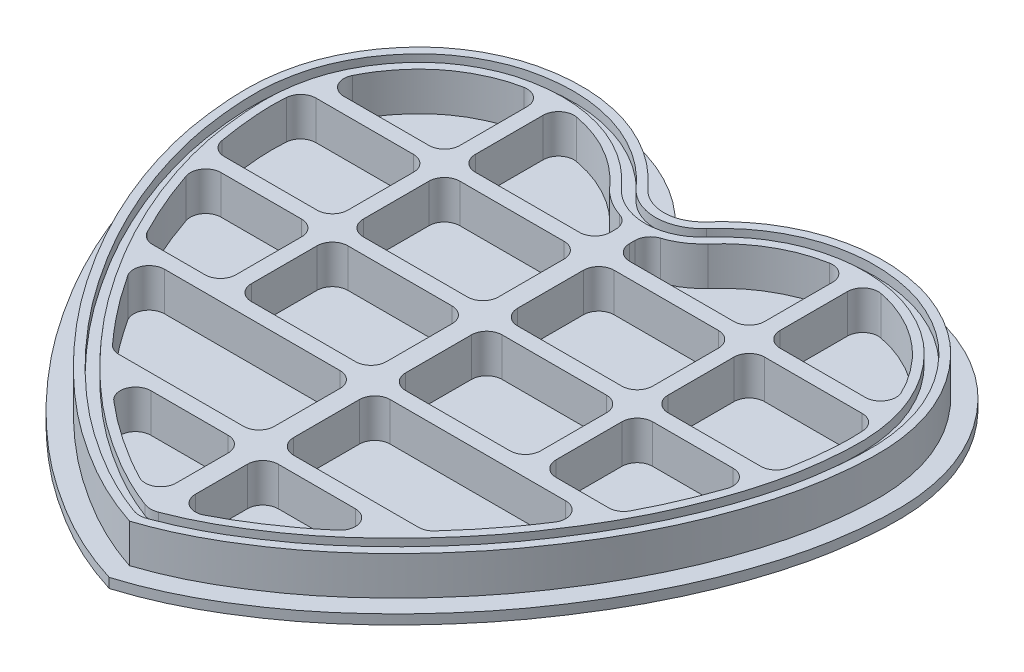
from build123d import *

# Parameters (mm, degrees)
BOSS_EXTRUDE1_DEPTH = 3.175
BOSS_EXTRUDE3_DEPTH = 12.7
SKETCH5_W           = 44.414591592
SKETCH5_H           = 31.75
SKETCH5_W_2         = 44.414591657
CUT_EXTRUDE1_DEPTH  = 12.7
FILLET1_R           = 5.08
CUT_EXTRUDE2_DEPTH  = 3.175
FILLET2_R           = 6.35


with BuildPart() as part:
    # Sketch1 → Boss-Extrude1 (new body)
    with BuildSketch(Plane(origin=(0, 0, 0), x_dir=(1, 0, 0), z_dir=(0, 1, 0))):
        with BuildLine():
            ThreePointArc((-4.747482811, 190.872547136), (0, 188.739644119), (4.747482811, 190.872547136))
            add(Edge.make_bspline(
                [(0, 0), (6.970442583, 2.141082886), (17.305199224, 6.509209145), (30.285067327, 14.366317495), (40.150784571, 21.183484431), (49.603424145, 29.074254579), (58.742982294, 37.735887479), (67.378539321, 47.138207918), (75.575238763, 57.113294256), (82.955034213, 67.748431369), (89.791932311, 78.721655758), (95.737965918, 90.115832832), (100.824893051, 101.755437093), (104.934029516, 113.602894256), (108.033406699, 125.514887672), (109.756308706, 137.469723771), (110.447054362, 147.556494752), (110.063190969, 155.716052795), (109.107499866, 161.898362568), (107.688011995, 167.863159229), (105.613562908, 173.559818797), (103.038708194, 178.971158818), (99.994025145, 184.084018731), (96.490424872, 188.811355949), (92.627716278, 193.232091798), (88.353251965, 197.256826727), (83.64560959, 200.815640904), (78.636807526, 203.933154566), (73.292192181, 206.507896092), (67.725724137, 208.658006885), (61.858228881, 210.069885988), (55.85226772, 211.016437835), (49.237488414, 211.368814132), (42.178295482, 210.949739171), (34.84505005, 209.532701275), (27.821079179, 207.307972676), (21.216319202, 204.168334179), (15.02880887, 200.345742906), (9.553920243, 195.844598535), (6.241235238, 192.554169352), (4.747482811, 190.872547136)],
                knots=[0, 0, 0, 0, 0.062261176, 0.095309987, 0.1294716, 0.164592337, 0.200365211, 0.236952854, 0.273568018, 0.310548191, 0.347436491, 0.383932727, 0.420222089, 0.455836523, 0.490947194, 0.525166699, 0.558872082, 0.577132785, 0.59481426, 0.612232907, 0.629419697, 0.646490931, 0.663353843, 0.68016217, 0.696680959, 0.713439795, 0.730210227, 0.74701014, 0.763742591, 0.780817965, 0.79787159, 0.815181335, 0.832691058, 0.854351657, 0.875405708, 0.896334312, 0.917107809, 0.937713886, 0.958296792, 0.977512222, 0.977512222, 0.977512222, 0.977512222], degree=3))
            add(Edge.make_bspline(
                [(0, 0), (-6.970442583, 2.141082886), (-17.305199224, 6.509209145), (-30.285067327, 14.366317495), (-40.150784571, 21.183484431), (-49.603424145, 29.074254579), (-58.742982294, 37.735887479), (-67.378539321, 47.138207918), (-75.575238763, 57.113294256), (-82.955034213, 67.748431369), (-89.791932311, 78.721655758), (-95.737965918, 90.115832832), (-100.824893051, 101.755437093), (-104.934029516, 113.602894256), (-108.033406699, 125.514887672), (-109.756308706, 137.469723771), (-110.447054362, 147.556494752), (-110.063190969, 155.716052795), (-109.107499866, 161.898362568), (-107.688011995, 167.863159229), (-105.613562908, 173.559818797), (-103.038708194, 178.971158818), (-99.994025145, 184.084018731), (-96.490424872, 188.811355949), (-92.627716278, 193.232091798), (-88.353251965, 197.256826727), (-83.64560959, 200.815640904), (-78.636807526, 203.933154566), (-73.292192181, 206.507896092), (-67.725724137, 208.658006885), (-61.858228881, 210.069885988), (-55.85226772, 211.016437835), (-49.237488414, 211.368814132), (-42.178295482, 210.949739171), (-34.84505005, 209.532701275), (-27.821079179, 207.307972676), (-21.216319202, 204.168334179), (-15.02880887, 200.345742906), (-9.553920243, 195.844598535), (-6.241235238, 192.554169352), (-4.747482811, 190.872547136)],
                knots=[0, 0, 0, 0, 0.062261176, 0.095309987, 0.1294716, 0.164592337, 0.200365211, 0.236952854, 0.273568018, 0.310548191, 0.347436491, 0.383932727, 0.420222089, 0.455836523, 0.490947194, 0.525166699, 0.558872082, 0.577132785, 0.59481426, 0.612232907, 0.629419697, 0.646490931, 0.663353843, 0.68016217, 0.696680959, 0.713439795, 0.730210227, 0.74701014, 0.763742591, 0.780817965, 0.79787159, 0.815181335, 0.832691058, 0.854351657, 0.875405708, 0.896334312, 0.917107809, 0.937713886, 0.958296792, 0.977512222, 0.977512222, 0.977512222, 0.977512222], degree=3))
        make_face()
    extrude(amount=BOSS_EXTRUDE1_DEPTH)

    # Sketch4 → Boss-Extrude3 (add)
    with BuildSketch(Plane(origin=(0, 3.175, 0), x_dir=(1, 0, 0), z_dir=(0, 1, 0))):
        with BuildLine():
            ThreePointArc((-9.494965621, 186.655450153), (0, 182.389644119), (9.494965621, 186.655450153))
            add(Edge.make_bspline(
                [(0, 6.662641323), (3.181841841, 7.707771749), (6.285990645, 8.901039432), (12.350490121, 11.561754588), (15.310465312, 13.029917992), (21.093504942, 16.227292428), (23.918881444, 17.952095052), (28.096349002, 20.654839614), (29.478667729, 21.575146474), (32.218537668, 23.462984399), (33.577568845, 24.431734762), (37.58122483, 27.40018831), (40.155182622, 29.472921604), (45.162919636, 33.75653076), (47.601691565, 35.962486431), (52.358131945, 40.493742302), (54.671953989, 42.822833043), (59.174698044, 47.604100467), (61.366446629, 50.053491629), (65.648634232, 55.052112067), (67.735834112, 57.604533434), (70.754266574, 61.54390078), (71.74089275, 62.876257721), (73.679788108, 65.574829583), (74.630438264, 66.938411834), (76.494971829, 69.679713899), (77.410342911, 71.058788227), (79.212522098, 73.831176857), (80.098316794, 75.224996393), (82.700482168, 79.433984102), (84.358850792, 82.278069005), (87.492518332, 88.057507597), (88.972881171, 90.990336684), (91.772460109, 96.936334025), (93.09027817, 99.950199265), (95.540218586, 106.070507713), (96.671550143, 109.177345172), (98.220571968, 113.911374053), (98.712774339, 115.502237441), (99.643955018, 118.707095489), (100.08035297, 120.314687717), (100.884795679, 123.54196168), (101.252845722, 125.161642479), (101.910121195, 128.414945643), (102.199079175, 130.048615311), (102.709192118, 133.327946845), (102.930348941, 134.973608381), (103.315851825, 138.274979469), (103.482880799, 139.9302145), (103.748659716, 143.252760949), (103.84583959, 144.91913922), (103.941219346, 148.238366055), (103.940020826, 149.894222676), (103.810934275, 153.196200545), (103.680827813, 154.842151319), (103.265645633, 158.122144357), (102.986498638, 159.756642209), (102.311354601, 163.016658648), (101.908240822, 164.649551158), (100.938478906, 167.823729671), (100.373143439, 169.372323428), (99.113988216, 172.408034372), (98.420322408, 173.895225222), (96.906703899, 176.809181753), (96.087453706, 178.236283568), (94.754465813, 180.327120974), (94.292326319, 181.015545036), (93.333339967, 182.375786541), (92.835604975, 183.0491751), (91.308755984, 185.030162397), (90.246665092, 186.30553099), (88.024632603, 188.755986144), (86.862916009, 189.929253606), (84.425164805, 192.158630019), (83.147012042, 193.212568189), (81.146040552, 194.707652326), (80.464470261, 195.192796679), (79.080538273, 196.134131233), (78.380961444, 196.588127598), (76.965405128, 197.460191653), (76.249426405, 197.878261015), (74.799757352, 198.675603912), (74.066068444, 199.054880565), (72.583546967, 199.78026292), (71.834712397, 200.12636424), (70.324209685, 200.79045599), (69.562862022, 201.109148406), (68.024207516, 201.711575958), (67.246860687, 201.995223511), (65.671370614, 202.51696577), (64.872483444, 202.75343097), (63.255016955, 203.183227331), (62.436294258, 203.377158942), (60.800475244, 203.729316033), (59.981093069, 203.889185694), (57.518706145, 204.322122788), (55.871167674, 204.545289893), (52.561606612, 204.832204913), (50.899823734, 204.898591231), (48.396790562, 204.88415615), (47.560706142, 204.860192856), (45.884899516, 204.772227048), (45.045459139, 204.708093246), (42.549210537, 204.45603933), (40.905738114, 204.206531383), (37.656381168, 203.559527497), (36.049925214, 203.164281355), (32.873279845, 202.231003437), (31.303718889, 201.690497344), (28.982643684, 200.748765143), (28.213988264, 200.413287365), (26.688456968, 199.703084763), (25.937184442, 199.331016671), (23.714130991, 198.169396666), (22.271091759, 197.337414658), (20.173044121, 195.991254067), (19.484928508, 195.525950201), (18.133260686, 194.559080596), (17.469702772, 194.057523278), (15.511572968, 192.504808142), (14.248520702, 191.406639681), (11.792698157, 189.108482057), (10.612083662, 187.913068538), (9.494965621, 186.655450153)],
                knots=[0, 0, 0, 0, 0.03125, 0.03125, 0.0625, 0.0625, 0.09375, 0.09375, 0.109375, 0.109375, 0.125, 0.125, 0.15625, 0.15625, 0.1875, 0.1875, 0.21875, 0.21875, 0.25, 0.25, 0.28125, 0.28125, 0.296875, 0.296875, 0.3125, 0.3125, 0.328125, 0.328125, 0.34375, 0.34375, 0.375, 0.375, 0.40625, 0.40625, 0.4375, 0.4375, 0.46875, 0.46875, 0.484375, 0.484375, 0.5, 0.5, 0.515625, 0.515625, 0.53125, 0.53125, 0.546875, 0.546875, 0.5625, 0.5625, 0.578125, 0.578125, 0.59375, 0.59375, 0.609375, 0.609375, 0.625, 0.625, 0.640625, 0.640625, 0.65625, 0.65625, 0.671875, 0.671875, 0.6875, 0.6875, 0.6953125, 0.6953125, 0.703125, 0.703125, 0.71875, 0.71875, 0.734375, 0.734375, 0.75, 0.75, 0.7578125, 0.7578125, 0.765625, 0.765625, 0.7734375, 0.7734375, 0.78125, 0.78125, 0.7890625, 0.7890625, 0.796875, 0.796875, 0.8046875, 0.8046875, 0.8125, 0.8125, 0.8203125, 0.8203125, 0.828125, 0.828125, 0.84375, 0.84375, 0.859375, 0.859375, 0.8671875, 0.8671875, 0.875, 0.875, 0.890625, 0.890625, 0.90625, 0.90625, 0.921875, 0.921875, 0.9296875, 0.9296875, 0.9375, 0.9375, 0.953125, 0.953125, 0.9609375, 0.9609375, 0.96875, 0.96875, 0.984375, 0.984375, 1, 1, 1, 1], degree=3))
            add(Edge.make_bspline(
                [(-9.494965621, 186.655450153), (-10.609815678, 187.910515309), (-11.780868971, 189.096022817), (-14.204196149, 191.36651847), (-15.45344557, 192.455249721), (-17.397313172, 194.001722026), (-18.057184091, 194.502466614), (-19.404222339, 195.470173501), (-20.091508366, 195.936988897), (-21.491613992, 196.839019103), (-22.204429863, 197.274238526), (-23.653760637, 198.115347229), (-24.390379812, 198.521505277), (-26.612461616, 199.68622144), (-28.118071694, 200.393636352), (-31.185995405, 201.64679261), (-32.749122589, 202.190214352), (-35.926273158, 203.131942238), (-37.539395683, 203.532816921), (-39.996630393, 204.027063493), (-40.824393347, 204.173796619), (-42.481525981, 204.42615659), (-43.309978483, 204.531572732), (-45.794998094, 204.786176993), (-47.451233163, 204.874789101), (-50.762877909, 204.901432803), (-52.418290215, 204.839944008), (-55.728265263, 204.561975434), (-57.384635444, 204.342229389), (-59.862965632, 203.911500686), (-60.683691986, 203.752641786), (-62.314578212, 203.404929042), (-63.124395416, 203.215102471), (-64.729373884, 202.793845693), (-65.524391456, 202.562007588), (-67.096682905, 202.047962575), (-67.87448419, 201.767252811), (-69.417001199, 201.168687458), (-70.181725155, 200.85085524), (-71.701215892, 200.186925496), (-72.455820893, 199.840368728), (-73.952739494, 199.112363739), (-74.695055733, 198.730923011), (-76.165101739, 197.926635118), (-76.890522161, 197.504683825), (-79.023584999, 196.195278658), (-80.39738752, 195.262732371), (-83.054448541, 193.285754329), (-84.333980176, 192.236717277), (-86.78515132, 190.005320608), (-87.95870264, 188.825323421), (-89.647895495, 186.967427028), (-90.199441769, 186.33327866), (-91.271797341, 185.049783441), (-91.794338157, 184.399289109), (-93.320761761, 182.42138126), (-94.281529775, 181.066314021), (-96.067910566, 178.269491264), (-96.896220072, 176.829465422), (-98.048269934, 174.611435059), (-98.417030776, 173.862306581), (-99.123420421, 172.344081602), (-99.461602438, 171.573521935), (-100.419392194, 169.253053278), (-100.984727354, 167.688611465), (-101.942857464, 164.518561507), (-102.335210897, 162.91284802), (-103.00129816, 159.67311962), (-103.278735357, 158.039988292), (-103.587898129, 155.564763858), (-103.672348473, 154.735250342), (-103.803429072, 153.067199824), (-103.850537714, 152.228830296), (-104.003834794, 148.056488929), (-103.872055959, 144.74646598), (-103.470679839, 139.803730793), (-103.303595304, 138.159796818), (-102.917862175, 134.877573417), (-102.6965891, 133.239571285), (-102.185807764, 129.971036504), (-101.896289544, 128.340504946), (-101.236754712, 125.088253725), (-100.867133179, 123.466490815), (-100.058184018, 120.230595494), (-99.620361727, 118.622652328), (-98.692151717, 115.434660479), (-98.20187958, 113.852347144), (-96.657484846, 109.138256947), (-95.528590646, 106.039862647), (-93.080722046, 99.927937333), (-91.762550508, 96.914047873), (-88.958539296, 90.961126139), (-87.474138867, 88.021451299), (-84.327088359, 82.221683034), (-82.659144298, 79.363953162), (-80.038725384, 75.130265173), (-79.145305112, 73.726155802), (-77.331655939, 70.939493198), (-76.412630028, 69.556703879), (-73.61231133, 65.445696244), (-71.686192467, 62.756207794), (-67.66823896, 57.520409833), (-65.580757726, 54.970338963), (-61.291655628, 49.968814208), (-59.093401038, 47.514451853), (-54.568612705, 42.716560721), (-52.239062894, 40.375637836), (-48.64030957, 36.954480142), (-47.423721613, 35.828785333), (-44.957328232, 33.606095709), (-43.706279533, 32.507080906), (-39.909556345, 29.270672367), (-37.325889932, 27.20227084), (-32.025946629, 23.290714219), (-29.314433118, 21.439468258), (-23.805721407, 17.882516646), (-21.008002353, 16.177695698), (-15.270127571, 13.009990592), (-12.327537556, 11.551241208), (-6.284987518, 8.901044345), (-3.185411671, 7.708944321), (0, 6.662641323)],
                knots=[0, 0, 0, 0, 0.015625, 0.015625, 0.03125, 0.03125, 0.0390625, 0.0390625, 0.046875, 0.046875, 0.0546875, 0.0546875, 0.0625, 0.0625, 0.078125, 0.078125, 0.09375, 0.09375, 0.109375, 0.109375, 0.1171875, 0.1171875, 0.125, 0.125, 0.140625, 0.140625, 0.15625, 0.15625, 0.171875, 0.171875, 0.1796875, 0.1796875, 0.1875, 0.1875, 0.1953125, 0.1953125, 0.203125, 0.203125, 0.2109375, 0.2109375, 0.21875, 0.21875, 0.2265625, 0.2265625, 0.234375, 0.234375, 0.25, 0.25, 0.265625, 0.265625, 0.28125, 0.28125, 0.2890625, 0.2890625, 0.296875, 0.296875, 0.3125, 0.3125, 0.328125, 0.328125, 0.3359375, 0.3359375, 0.34375, 0.34375, 0.359375, 0.359375, 0.375, 0.375, 0.390625, 0.390625, 0.3984375, 0.3984375, 0.40625, 0.40625, 0.4375, 0.4375, 0.453125, 0.453125, 0.46875, 0.46875, 0.484375, 0.484375, 0.5, 0.5, 0.515625, 0.515625, 0.53125, 0.53125, 0.5625, 0.5625, 0.59375, 0.59375, 0.625, 0.625, 0.65625, 0.65625, 0.671875, 0.671875, 0.6875, 0.6875, 0.71875, 0.71875, 0.75, 0.75, 0.78125, 0.78125, 0.8125, 0.8125, 0.828125, 0.828125, 0.84375, 0.84375, 0.875, 0.875, 0.90625, 0.90625, 0.9375, 0.9375, 0.96875, 0.96875, 1, 1, 1, 1], degree=3))
        make_face()
    extrude(amount=BOSS_EXTRUDE3_DEPTH)

    # Sketch5 → Cut-Extrude1 (cut)
    with BuildSketch(Plane(origin=(0, 15.875, 0), x_dir=(1, 0, 0), z_dir=(0, 1, 0))):
        with BuildLine():
            Line((-47.589591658, 162.905866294), (-3.175000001, 162.905866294))
            Line((-3.175000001, 162.905866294), (-3.175000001, 173.734376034))
            ThreePointArc((-3.175000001, 173.734376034), (-10.275762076, 176.101837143), (-16.141441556, 180.751514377))
            add(Edge.make_bspline(
                [(-16.141441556, 180.751514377), (-17.134877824, 181.869895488), (-18.182186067, 182.919409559), (-20.346497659, 184.92934322), (-21.4624121, 185.891154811), (-23.202990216, 187.24859825), (-23.794738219, 187.686307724), (-25.004666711, 188.527936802), (-25.622362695, 188.93247577), (-26.880681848, 189.712244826), (-27.521309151, 190.087469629), (-28.82328044, 190.811436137), (-29.486356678, 191.161295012), (-31.489577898, 192.157966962), (-32.846848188, 192.751821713), (-35.612370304, 193.774362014), (-37.019232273, 194.207550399), (-39.872688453, 194.945203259), (-41.319487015, 195.249005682), (-43.523415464, 195.59542941), (-44.266150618, 195.692330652), (-45.74981945, 195.845647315), (-46.490787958, 195.902539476), (-47.350508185, 195.946838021), (-47.47006043, 195.952518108), (-47.589591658, 195.957718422)],
                knots=[0, 0, 0, 0, 0.015625, 0.015625, 0.03125, 0.03125, 0.0390625, 0.0390625, 0.046875, 0.046875, 0.0546875, 0.0546875, 0.0625, 0.0625, 0.078125, 0.078125, 0.09375, 0.09375, 0.109375, 0.109375, 0.1171875, 0.1171875, 0.125, 0.125, 0.126262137, 0.126262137, 0.126262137, 0.126262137], degree=3))
            Line((-47.589591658, 195.957718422), (-47.589591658, 162.905866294))
        make_face()
        with BuildLine():
            Line((52.669591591, 195.892387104), (52.669591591, 162.905866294))
            Line((52.669591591, 162.905866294), (93.136976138, 162.905866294))
            add(Edge.make_bspline(
                [(93.136976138, 162.905866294), (93.014719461, 163.33657048), (92.885618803, 163.763912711), (92.523462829, 164.888871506), (92.278813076, 165.580792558), (91.495662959, 167.63238687), (90.910596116, 168.969185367), (89.625036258, 171.586081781), (88.924790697, 172.866301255), (87.398468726, 175.364928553), (86.568299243, 176.581325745), (85.231482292, 178.360943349), (84.773488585, 178.944715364), (83.838725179, 180.089434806), (83.3608776, 180.650844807), (81.893937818, 182.3001338), (80.87048975, 183.352068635), (78.715202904, 185.342536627), (77.581035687, 186.2786337), (75.208285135, 188.041584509), (73.968803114, 188.877218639), (72.072397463, 190.024114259), (71.432448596, 190.388672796), (70.135969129, 191.080142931), (69.479790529, 191.407853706), (68.154493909, 192.033897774), (67.485488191, 192.332486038), (66.136405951, 192.904527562), (65.45593719, 193.17709029), (64.078326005, 193.684360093), (63.380751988, 193.918087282), (61.963665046, 194.335731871), (61.244845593, 194.521223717), (59.792403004, 194.858597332), (59.062620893, 195.010249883), (57.602880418, 195.285823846), (56.871890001, 195.409528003), (54.98637985, 195.68542291), (53.829799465, 195.811707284), (52.669591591, 195.892387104)],
                knots=[0.659341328, 0.659341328, 0.659341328, 0.659341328, 0.6640625, 0.6640625, 0.671875, 0.671875, 0.6875, 0.6875, 0.703125, 0.703125, 0.71875, 0.71875, 0.7265625, 0.7265625, 0.734375, 0.734375, 0.75, 0.75, 0.765625, 0.765625, 0.78125, 0.78125, 0.7890625, 0.7890625, 0.796875, 0.796875, 0.8046875, 0.8046875, 0.8125, 0.8125, 0.8203125, 0.8203125, 0.828125, 0.828125, 0.8359375, 0.8359375, 0.84375, 0.84375, 0.856052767, 0.856052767, 0.856052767, 0.856052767], degree=3))
        make_face()
        with Locations((25.382295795, 141.950866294)):
            Rectangle(SKETCH5_W, SKETCH5_H)
        with BuildLine():
            ThreePointArc((16.141441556, 180.751514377), (10.275762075, 176.101837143), (3.174999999, 173.734376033))
            Line((3.174999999, 173.734376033), (3.174999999, 162.905866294))
            Line((3.174999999, 162.905866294), (47.589591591, 162.905866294))
            Line((47.589591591, 162.905866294), (47.589591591, 195.957663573))
            add(Edge.make_bspline(
                [(47.589591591, 195.957663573), (47.48760758, 195.953226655), (47.385595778, 195.948440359), (46.539747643, 195.905860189), (45.792588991, 195.849277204), (44.311462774, 195.697754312), (43.576127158, 195.602448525), (41.384898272, 195.261279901), (39.943561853, 194.960992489), (37.095855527, 194.229686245), (35.68922372, 193.799646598), (33.611021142, 193.035899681), (32.923765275, 192.760835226), (31.560083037, 192.170217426), (30.881859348, 191.854336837), (28.873894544, 190.858903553), (27.574196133, 190.139446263), (25.685546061, 188.97295159), (25.066422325, 188.569171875), (23.851880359, 187.727625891), (23.256907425, 187.2892212), (21.504836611, 185.926913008), (20.378897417, 184.958337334), (18.191348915, 182.928956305), (17.134366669, 181.869320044), (16.141441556, 180.751514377)],
                knots=[0.873928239, 0.873928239, 0.873928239, 0.873928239, 0.875, 0.875, 0.8828125, 0.8828125, 0.890625, 0.890625, 0.90625, 0.90625, 0.921875, 0.921875, 0.9296875, 0.9296875, 0.9375, 0.9375, 0.953125, 0.953125, 0.9609375, 0.9609375, 0.96875, 0.96875, 0.984375, 0.984375, 1, 1, 1, 1], degree=3))
        make_face()
        with BuildLine():
            Line((94.280557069, 157.825866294), (52.669591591, 157.825866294))
            Line((52.669591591, 157.825866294), (52.669591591, 126.075866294))
            Line((52.669591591, 126.075866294), (92.334289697, 126.075866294))
            add(Edge.make_bspline(
                [(92.334289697, 126.075866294), (92.400784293, 126.366329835), (92.465995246, 126.656986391), (93.164564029, 129.837219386), (93.658918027, 132.748588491), (94.240680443, 137.140666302), (94.409617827, 138.608605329), (94.700586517, 141.551830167), (94.821569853, 143.028053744), (94.990983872, 145.98865332), (95.038830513, 147.46583143), (95.034854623, 150.41174674), (94.983099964, 151.880489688), (94.743881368, 154.806482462), (94.551938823, 156.263352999), (94.293485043, 157.75204755), (94.287039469, 157.788958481), (94.280557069, 157.825866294)],
                knots=[0.528104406, 0.528104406, 0.528104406, 0.528104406, 0.53125, 0.53125, 0.5625, 0.5625, 0.578125, 0.578125, 0.59375, 0.59375, 0.609375, 0.609375, 0.625, 0.625, 0.640625, 0.640625, 0.641022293, 0.641022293, 0.641022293, 0.641022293], degree=3))
        make_face()
        with Locations((-25.38229583, 141.950866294)):
            Rectangle(SKETCH5_W_2, SKETCH5_H)
        with BuildLine():
            Line((-52.669591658, 126.075866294), (-52.669591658, 157.825866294))
            Line((-52.669591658, 157.825866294), (-94.280523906, 157.825866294))
            add(Edge.make_bspline(
                [(-94.280523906, 157.825866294), (-94.293666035, 157.751049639), (-94.306658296, 157.676203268), (-94.567629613, 156.154479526), (-94.757422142, 154.696064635), (-94.990114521, 151.750108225), (-95.038561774, 150.258548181), (-95.036098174, 147.298480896), (-94.984718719, 145.825455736), (-94.811051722, 142.889315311), (-94.689390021, 141.426112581), (-94.398196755, 138.506397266), (-94.229580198, 137.049756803), (-93.649233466, 132.690246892), (-93.156751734, 129.798663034), (-92.462807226, 126.642791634), (-92.399160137, 126.359243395), (-92.334288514, 126.075866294)],
                knots=[0.358566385, 0.358566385, 0.358566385, 0.358566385, 0.359375, 0.359375, 0.375, 0.375, 0.390625, 0.390625, 0.40625, 0.40625, 0.421875, 0.421875, 0.4375, 0.4375, 0.46875, 0.46875, 0.471837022, 0.471837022, 0.471837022, 0.471837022], degree=3))
            Line((-92.334288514, 126.075866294), (-52.669591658, 126.075866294))
        make_face()
        with BuildLine():
            add(Edge.make_bspline(
                [(-52.669591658, 195.892346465), (-53.806440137, 195.813251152), (-54.941367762, 195.690308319), (-56.808305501, 195.419763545), (-57.541388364, 195.296649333), (-59.006292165, 195.021614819), (-59.737750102, 194.870282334), (-61.184699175, 194.536168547), (-61.901493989, 194.352422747), (-63.316543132, 193.938608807), (-64.014016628, 193.706589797), (-65.392619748, 193.201717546), (-66.074152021, 192.929870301), (-67.426154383, 192.358537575), (-68.097013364, 192.060023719), (-69.427017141, 191.433728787), (-70.086048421, 191.105664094), (-71.389360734, 190.412682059), (-72.033292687, 190.046892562), (-73.306461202, 189.278597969), (-73.936089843, 188.87670056), (-75.168385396, 188.048809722), (-75.772759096, 187.621524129), (-77.552106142, 186.30140093), (-78.688943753, 185.365355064), (-80.85327046, 183.369370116), (-81.883306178, 182.312316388), (-83.361008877, 180.650426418), (-83.843100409, 180.083242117), (-84.785112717, 178.92973652), (-85.243459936, 178.345489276), (-86.57723204, 176.568314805), (-87.408926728, 175.349498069), (-88.942755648, 172.835161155), (-89.648976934, 171.542060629), (-90.623045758, 169.55193168), (-90.933187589, 168.879942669), (-91.523871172, 167.518440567), (-91.80536527, 166.827123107), (-92.331423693, 165.435384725), (-92.575624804, 164.735782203), (-92.917680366, 163.657836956), (-93.030249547, 163.282411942), (-93.137167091, 162.905866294)],
                knots=[0.144186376, 0.144186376, 0.144186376, 0.144186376, 0.15625, 0.15625, 0.1640625, 0.1640625, 0.171875, 0.171875, 0.1796875, 0.1796875, 0.1875, 0.1875, 0.1953125, 0.1953125, 0.203125, 0.203125, 0.2109375, 0.2109375, 0.21875, 0.21875, 0.2265625, 0.2265625, 0.234375, 0.234375, 0.25, 0.25, 0.265625, 0.265625, 0.2734375, 0.2734375, 0.28125, 0.28125, 0.296875, 0.296875, 0.3125, 0.3125, 0.3203125, 0.3203125, 0.328125, 0.328125, 0.3359375, 0.3359375, 0.34009163, 0.34009163, 0.34009163, 0.34009163], degree=3))
            Line((-93.137167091, 162.905866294), (-52.669591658, 162.905866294))
            Line((-52.669591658, 162.905866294), (-52.669591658, 195.892346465))
        make_face()
        with BuildLine():
            add(Edge.make_bspline(
                [(-91.042683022, 120.995866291), (-90.797619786, 120.115152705), (-90.542696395, 119.236253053), (-88.576459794, 112.696412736), (-86.531243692, 107.197172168), (-83.016736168, 99.164430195), (-81.773493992, 96.521559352), (-79.675206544, 92.343836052), (-78.862561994, 90.788468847), (-78.023534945, 89.245866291)],
                knots=[0.490344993, 0.490344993, 0.490344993, 0.490344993, 0.5, 0.5, 0.5625, 0.5625, 0.59375, 0.59375, 0.612518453, 0.612518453, 0.612518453, 0.612518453], degree=3))
            Line((-78.023534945, 89.245866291), (-52.669591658, 89.245866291))
            Line((-52.669591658, 89.245866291), (-52.669591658, 120.995866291))
            Line((-52.669591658, 120.995866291), (-91.042683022, 120.995866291))
        make_face()
        with Locations((-25.38229583, 105.120866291)):
            Rectangle(SKETCH5_W_2, SKETCH5_H)
        with Locations((25.382295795, 105.120866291)):
            Rectangle(SKETCH5_W, SKETCH5_H)
        with BuildLine():
            Line((52.669591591, 120.995866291), (52.669591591, 89.245866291))
            Line((52.669591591, 89.245866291), (78.023542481, 89.245866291))
            add(Edge.make_bspline(
                [(78.023542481, 89.245866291), (78.87086846, 90.803732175), (79.691181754, 92.374435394), (81.793845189, 96.564113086), (83.034347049, 99.202975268), (86.540560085, 107.221876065), (88.580231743, 112.709336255), (90.541991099, 119.233824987), (90.796970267, 120.112652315), (91.042718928, 120.995866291)],
                knots=[0.387272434, 0.387272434, 0.387272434, 0.387272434, 0.40625, 0.40625, 0.4375, 0.4375, 0.5, 0.5, 0.509679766, 0.509679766, 0.509679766, 0.509679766], degree=3))
            Line((91.042718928, 120.995866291), (52.669591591, 120.995866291))
        make_face()
        with BuildLine():
            add(Edge.make_bspline(
                [(-75.136960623, 84.165866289), (-74.040405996, 82.315054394), (-72.906923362, 80.482109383), (-70.951126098, 77.424830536), (-70.145640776, 76.192354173), (-68.509893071, 73.739389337), (-67.678612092, 72.518507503), (-65.147912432, 68.896150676), (-63.4065741, 66.532077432), (-59.792160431, 61.927468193), (-57.924723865, 59.681644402), (-54.532453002, 55.763551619), (-53.024177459, 54.075754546), (-51.486140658, 52.415866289)],
                knots=[0.633312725, 0.633312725, 0.633312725, 0.633312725, 0.65625, 0.65625, 0.671875, 0.671875, 0.6875, 0.6875, 0.71875, 0.71875, 0.75, 0.75, 0.774253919, 0.774253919, 0.774253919, 0.774253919], degree=3))
            Line((-51.486140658, 52.415866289), (-3.175000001, 52.415866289))
            Line((-3.175000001, 52.415866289), (-3.175000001, 84.165866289))
            Line((-3.175000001, 84.165866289), (-75.136960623, 84.165866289))
        make_face()
        with BuildLine():
            Line((3.174999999, 84.165866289), (3.174999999, 52.415866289))
            Line((3.174999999, 52.415866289), (51.486157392, 52.415866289))
            add(Edge.make_bspline(
                [(51.486157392, 52.415866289), (53.037030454, 54.089569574), (54.557955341, 55.791983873), (57.962541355, 59.726569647), (59.830230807, 61.974053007), (62.541873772, 65.431455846), (63.430292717, 66.598746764), (65.175353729, 68.963792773), (66.032511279, 70.161053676), (67.721034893, 72.580301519), (68.551934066, 73.801601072), (70.185858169, 76.253495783), (70.990400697, 77.485345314), (72.931931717, 80.52249775), (74.052577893, 82.335567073), (75.136968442, 84.165866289)],
                knots=[0.225540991, 0.225540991, 0.225540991, 0.225540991, 0.25, 0.25, 0.28125, 0.28125, 0.296875, 0.296875, 0.3125, 0.3125, 0.328125, 0.328125, 0.34375, 0.34375, 0.366455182, 0.366455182, 0.366455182, 0.366455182], degree=3))
            Line((75.136968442, 84.165866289), (3.174999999, 84.165866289))
        make_face()
        with BuildLine():
            Line((46.589569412, 47.335866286), (3.174999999, 47.335866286))
            Line((3.174999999, 47.335866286), (3.174999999, 17.287844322))
            add(Edge.make_bspline(
                [(3.174999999, 17.287844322), (4.868695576, 17.973257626), (6.5368973, 18.704818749), (9.511521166, 20.108288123), (10.826254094, 20.765152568), (13.424671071, 22.135084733), (14.707904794, 22.848967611), (17.247905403, 24.324642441), (18.504803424, 25.086197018), (20.998136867, 26.64634664), (22.235068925, 27.444042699), (24.691135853, 29.071650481), (25.909652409, 29.902681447), (28.323787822, 31.606191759), (29.521105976, 32.479838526), (33.046961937, 35.15666357), (35.318069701, 37.017393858), (39.748448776, 40.846070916), (41.909259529, 42.812541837), (44.884936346, 45.655232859), (45.741757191, 46.491231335), (46.589569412, 47.335866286)],
                knots=[0.011948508, 0.011948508, 0.011948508, 0.011948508, 0.03125, 0.03125, 0.046875, 0.046875, 0.0625, 0.0625, 0.078125, 0.078125, 0.09375, 0.09375, 0.109375, 0.109375, 0.125, 0.125, 0.15625, 0.15625, 0.1875, 0.1875, 0.200326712, 0.200326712, 0.200326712, 0.200326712], degree=3))
        make_face()
        with BuildLine():
            Line((-3.175000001, 47.335866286), (-46.589555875, 47.335866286))
            add(Edge.make_bspline(
                [(-46.589555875, 47.335866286), (-45.727127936, 46.476691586), (-44.855281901, 45.626348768), (-41.861769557, 42.768587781), (-39.697346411, 40.801265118), (-35.260133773, 36.968241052), (-32.982185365, 35.105415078), (-28.271008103, 31.533366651), (-25.860299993, 29.845021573), (-22.187443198, 27.41315168), (-20.954231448, 26.618346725), (-18.468064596, 25.063724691), (-17.214616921, 24.304780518), (-14.681177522, 22.833931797), (-13.401066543, 22.122238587), (-10.80851632, 20.756142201), (-9.496521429, 20.100951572), (-6.528869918, 18.701314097), (-4.864845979, 17.971695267), (-3.175000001, 17.287836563)],
                knots=[0.799459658, 0.799459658, 0.799459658, 0.799459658, 0.8125, 0.8125, 0.84375, 0.84375, 0.875, 0.875, 0.90625, 0.90625, 0.921875, 0.921875, 0.9375, 0.9375, 0.953125, 0.953125, 0.96875, 0.96875, 0.988035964, 0.988035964, 0.988035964, 0.988035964], degree=3))
            Line((-3.175000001, 17.287836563), (-3.175000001, 47.335866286))
        make_face()
    extrude(amount=-CUT_EXTRUDE1_DEPTH, mode=Mode.SUBTRACT)

    # Fillet1
    fillet1_edges = [part.edges().sort_by_distance(p)[0] for p in [
        (-52.669591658, 9.525, -89.245866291),
        (-52.669591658, 9.525, -120.995866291),
        (-52.669591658, 9.525, -157.825866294),
        (-52.669591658, 9.525, -126.075866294),
        (-3.175000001, 9.525, -157.825866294),
        (-47.589591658, 9.525, -157.825866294),
        (-3.175000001, 9.525, -126.075866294),
        (-47.589591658, 9.525, -126.075866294),
        (-3.175000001, 9.525, -120.995866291),
        (-47.589591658, 9.525, -120.995866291),
        (-47.589591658, 9.525, -89.245866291),
        (-3.175000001, 9.525, -89.245866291),
        (3.174999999, 9.525, -47.335866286),
        (-3.175000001, 9.525, -47.335866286),
        (-3.175000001, 9.525, -84.165866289),
        (-3.175000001, 9.525, -52.415866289),
        (3.174999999, 9.525, -84.165866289),
        (3.174999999, 9.525, -52.415866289),
        (52.669591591, 9.525, -120.995866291),
        (52.669591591, 9.525, -89.245866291),
        (47.589591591, 9.525, -120.995866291),
        (47.589591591, 9.525, -89.245866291),
        (3.174999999, 9.525, -89.245866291),
        (3.174999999, 9.525, -120.995866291),
        (47.589591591, 9.525, -126.075866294),
        (3.174999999, 9.525, -126.075866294),
        (3.174999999, 9.525, -157.825866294),
        (47.589591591, 9.525, -157.825866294),
        (52.669591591, 9.525, -126.075866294),
        (52.669591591, 9.525, -157.825866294),
        (52.669591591, 9.525, -162.905866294),
        (47.589591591, 9.525, -162.905866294),
        (3.174999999, 9.525, -162.905866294),
        (-3.175000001, 9.525, -162.905866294),
        (-52.669591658, 9.525, -162.905866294),
        (-47.589591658, 9.525, -162.905866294),
        (-78.023534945, 9.525, -89.245866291),
        (-51.486140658, 9.525, -52.415866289),
        (-75.136960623, 9.525, -84.165866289),
        (-46.589555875, 9.525, -47.335866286),
        (-3.175000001, 9.525, -17.287836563),
        (3.174999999, 9.525, -17.287844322),
        (46.589569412, 9.525, -47.335866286),
        (51.486157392, 9.525, -52.415866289),
        (75.136968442, 9.525, -84.165866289),
        (78.023542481, 9.525, -89.245866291),
        (91.042718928, 9.525, -120.995866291),
        (92.334289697, 9.525, -126.075866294),
        (94.280557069, 9.525, -157.825866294),
        (93.136976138, 9.525, -162.905866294),
        (52.669591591, 9.525, -195.892387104),
        (47.589591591, 9.525, -195.957663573),
        (-47.589591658, 9.525, -195.957718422),
        (-93.137167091, 9.525, -162.905866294),
        (-52.669591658, 9.525, -195.892346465),
        (-92.334288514, 9.525, -126.075866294),
        (-94.280523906, 9.525, -157.825866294),
        (-91.042683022, 9.525, -120.995866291),
        (-3.175000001, 9.525, -173.734376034),
        (3.174999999, 9.525, -173.734376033),
    ]]
    fillet(fillet1_edges, radius=FILLET1_R)

    # Sketch7 → Cut-Extrude2 (cut)
    with BuildSketch(Plane(origin=(0, 15.875, 0), x_dir=(1, 0, 0), z_dir=(0, 1, 0))):
        with BuildLine():
            ThreePointArc((-11.53638323, 184.842098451), (0, 179.659144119), (11.53638323, 184.842098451))
            add(Edge.make_bspline(
                [(-1.71e-06, 9.540941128), (6.128803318, 11.615613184), (11.960292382, 14.252765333), (20.318075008, 18.945280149), (23.042491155, 20.625822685), (27.073164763, 23.252487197), (28.406771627, 24.146867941), (31.04979818, 25.98138817), (32.358728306, 26.920978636), (36.213254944, 29.800505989), (38.693336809, 31.808952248), (43.523459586, 35.954664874), (45.877211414, 38.088255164), (50.470087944, 42.468986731), (52.705659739, 44.719647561), (57.05868827, 49.337975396), (59.178718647, 51.703092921), (63.322842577, 56.528364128), (65.344954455, 58.990480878), (68.272788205, 62.788001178), (69.230347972, 64.072053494), (71.112084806, 66.673227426), (72.034628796, 67.987632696), (73.844153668, 70.630404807), (74.732438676, 71.960088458), (76.48159367, 74.633261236), (77.342531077, 75.976716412), (79.874467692, 80.032701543), (81.492631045, 82.771838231), (84.557680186, 88.33636244), (86.006226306, 91.160913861), (88.750765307, 96.886838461), (90.046904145, 99.78813814), (92.465874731, 105.678010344), (93.587793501, 108.667042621), (95.130775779, 113.221038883), (95.622025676, 114.750658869), (96.556274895, 117.834196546), (96.998492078, 119.384591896), (97.820279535, 122.493378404), (98.20035272, 124.053448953), (98.888819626, 127.186793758), (99.195620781, 128.760361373), (99.738372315, 131.920547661), (99.975352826, 133.506976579), (100.391253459, 136.690529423), (100.571834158, 138.287347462), (100.878336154, 141.491052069), (101.003076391, 143.100271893), (101.167900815, 146.308952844), (101.208345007, 147.910596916), (101.178320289, 151.106759), (101.107517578, 152.701255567), (100.820893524, 155.880931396), (100.601561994, 157.465885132), (100.17874185, 159.83728771), (100.02292978, 160.626799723), (99.68030137, 162.203831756), (99.492151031, 162.992748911), (99.079810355, 164.551647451), (98.854733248, 165.322939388), (98.363446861, 166.847776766), (98.098162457, 167.601721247), (97.249624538, 169.840823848), (96.616118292, 171.304300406), (95.223214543, 174.176937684), (94.463846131, 175.586110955), (93.22253902, 177.655753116), (92.790318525, 178.339936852), (91.895859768, 179.682191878), (91.433956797, 180.340155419), (90.009250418, 182.279060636), (89.010867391, 183.528083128), (86.919800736, 185.941529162), (85.825094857, 187.104138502), (84.093964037, 188.768144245), (83.502161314, 189.309572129), (82.286518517, 190.363686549), (81.661864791, 190.877552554), (79.749565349, 192.371946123), (78.436701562, 193.29819327), (75.745435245, 195.029924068), (74.363586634, 195.82905787), (72.231950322, 196.919295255), (71.512300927, 197.265932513), (70.05752571, 197.930689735), (69.322901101, 198.249733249), (67.837813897, 198.858636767), (67.087018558, 199.147883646), (65.562949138, 199.684957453), (64.790245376, 199.93060476), (63.242471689, 200.369278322), (62.46499848, 200.564382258), (60.904862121, 200.919522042), (60.122284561, 201.080136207), (57.768216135, 201.519168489), (56.190099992, 201.75282003), (53.011451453, 202.068657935), (51.410939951, 202.150985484), (48.993625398, 202.162667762), (48.183654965, 202.147806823), (46.57449081, 202.079752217), (45.773545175, 202.026630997), (43.381722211, 201.809436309), (41.802266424, 201.585391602), (38.671520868, 200.989410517), (37.119763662, 200.619928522), (34.812406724, 199.959227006), (34.046704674, 199.721051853), (32.523038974, 199.204069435), (31.762759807, 198.924401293), (29.517178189, 198.027994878), (28.064633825, 197.354502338), (25.230106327, 195.887212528), (23.846295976, 195.096530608), (21.828272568, 193.812144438), (21.165335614, 193.367413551), (19.861239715, 192.440820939), (19.220190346, 191.958772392), (17.957583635, 190.96144199), (17.334825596, 190.445574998), (16.112628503, 189.389626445), (15.513164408, 188.849601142), (13.745353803, 187.19784857), (12.610556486, 186.05137087), (11.53638323, 184.842098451)],
                knots=[0, 0, 0, 0, 0.0625, 0.0625, 0.09375, 0.09375, 0.109375, 0.109375, 0.125, 0.125, 0.15625, 0.15625, 0.1875, 0.1875, 0.21875, 0.21875, 0.25, 0.25, 0.28125, 0.28125, 0.296875, 0.296875, 0.3125, 0.3125, 0.328125, 0.328125, 0.34375, 0.34375, 0.375, 0.375, 0.40625, 0.40625, 0.4375, 0.4375, 0.46875, 0.46875, 0.484375, 0.484375, 0.5, 0.5, 0.515625, 0.515625, 0.53125, 0.53125, 0.546875, 0.546875, 0.5625, 0.5625, 0.578125, 0.578125, 0.59375, 0.59375, 0.609375, 0.609375, 0.625, 0.625, 0.6328125, 0.6328125, 0.640625, 0.640625, 0.6484375, 0.6484375, 0.65625, 0.65625, 0.671875, 0.671875, 0.6875, 0.6875, 0.6953125, 0.6953125, 0.703125, 0.703125, 0.71875, 0.71875, 0.734375, 0.734375, 0.7421875, 0.7421875, 0.75, 0.75, 0.765625, 0.765625, 0.78125, 0.78125, 0.7890625, 0.7890625, 0.796875, 0.796875, 0.8046875, 0.8046875, 0.8125, 0.8125, 0.8203125, 0.8203125, 0.828125, 0.828125, 0.84375, 0.84375, 0.859375, 0.859375, 0.8671875, 0.8671875, 0.875, 0.875, 0.890625, 0.890625, 0.90625, 0.90625, 0.9140625, 0.9140625, 0.921875, 0.921875, 0.9375, 0.9375, 0.953125, 0.953125, 0.9609375, 0.9609375, 0.96875, 0.96875, 0.9765625, 0.9765625, 0.984375, 0.984375, 1, 1, 1, 1], degree=3))
            add(Edge.make_bspline(
                [(-11.53638323, 184.842098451), (-12.617342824, 186.059010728), (-13.752844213, 187.204852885), (-16.09972829, 189.397660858), (-17.308812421, 190.447621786), (-19.189495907, 191.93518487), (-19.827821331, 192.416144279), (-21.130800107, 193.343756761), (-21.795344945, 193.790551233), (-23.824898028, 195.084131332), (-25.224934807, 195.885273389), (-27.3885562, 197.004157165), (-28.120902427, 197.362285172), (-29.592771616, 198.037400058), (-30.334314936, 198.355561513), (-32.577306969, 199.246546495), (-34.097044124, 199.756125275), (-37.177189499, 200.634634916), (-38.737326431, 201.00450394), (-41.108575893, 201.451951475), (-41.904278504, 201.582820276), (-43.507107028, 201.805054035), (-44.316557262, 201.896554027), (-46.741894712, 202.109511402), (-48.353991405, 202.17052565), (-51.569443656, 202.144969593), (-53.172767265, 202.057859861), (-56.370253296, 201.728963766), (-57.96446412, 201.487994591), (-60.350317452, 201.034305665), (-61.146618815, 200.867894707), (-62.72300163, 200.501021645), (-63.503732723, 200.299889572), (-65.816893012, 199.627628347), (-67.316582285, 199.078841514), (-70.263392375, 197.856577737), (-71.71405769, 197.191508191), (-74.556608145, 195.721945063), (-75.945160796, 194.909546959), (-78.66298409, 193.144136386), (-79.974840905, 192.206059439), (-82.491712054, 190.217046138), (-83.694710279, 189.161967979), (-85.99149699, 186.932487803), (-87.086534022, 185.75944996), (-88.660571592, 183.925029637), (-89.174775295, 183.30059423), (-90.17890739, 182.031974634), (-90.667114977, 181.389833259), (-92.08503579, 179.437017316), (-92.966005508, 178.098797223), (-94.595845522, 175.347706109), (-95.347949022, 173.93666221), (-96.731363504, 171.046313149), (-97.363251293, 169.567333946), (-98.209121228, 167.291245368), (-98.471998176, 166.52656424), (-98.953656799, 164.991705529), (-99.172120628, 164.220287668), (-99.570897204, 162.670648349), (-99.75141226, 161.892462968), (-100.082193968, 160.330697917), (-100.233486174, 159.547301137), (-100.64266548, 157.189139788), (-100.85398226, 155.606070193), (-101.057191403, 153.211177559), (-101.10664717, 152.409619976), (-101.173979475, 150.800873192), (-101.191943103, 149.992122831), (-101.212093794, 145.960305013), (-101.007404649, 142.769294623), (-100.541183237, 138.007610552), (-100.359392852, 136.424498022), (-99.940594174, 133.266886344), (-99.702240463, 131.692597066), (-99.156838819, 128.554734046), (-98.848633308, 126.991340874), (-98.158267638, 123.876090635), (-97.777622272, 122.323997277), (-96.955090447, 119.229363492), (-96.51326925, 117.686812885), (-95.577538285, 114.609836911), (-95.083933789, 113.077980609), (-93.535937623, 108.524331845), (-92.410733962, 105.535785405), (-89.985591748, 99.647215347), (-88.686619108, 96.746702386), (-85.936767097, 91.022634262), (-84.485590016, 88.199229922), (-81.415101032, 82.637600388), (-79.794460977, 79.900048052), (-77.259633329, 75.846340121), (-76.397888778, 74.503616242), (-74.647277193, 71.831909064), (-73.758312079, 70.502975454), (-71.947042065, 67.861998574), (-71.023181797, 66.5484505), (-69.143848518, 63.955444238), (-68.187590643, 62.675299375), (-65.263445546, 58.889458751), (-63.244282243, 56.434319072), (-59.106686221, 51.621915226), (-56.990049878, 49.262879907), (-52.643723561, 44.656275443), (-50.411427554, 42.411275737), (-45.825583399, 38.04082589), (-43.475263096, 35.912193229), (-38.652658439, 31.775179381), (-36.175524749, 29.77157944), (-32.326615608, 26.897517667), (-31.019629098, 25.959888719), (-28.378617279, 24.127697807), (-27.046062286, 23.23446505), (-23.01873698, 20.611046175), (-20.29671104, 18.932576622), (-11.94654892, 14.24646125), (-6.121198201, 11.613022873), (-1.71e-06, 9.540941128)],
                knots=[0, 0, 0, 0, 0.015625, 0.015625, 0.03125, 0.03125, 0.0390625, 0.0390625, 0.046875, 0.046875, 0.0625, 0.0625, 0.0703125, 0.0703125, 0.078125, 0.078125, 0.09375, 0.09375, 0.109375, 0.109375, 0.1171875, 0.1171875, 0.125, 0.125, 0.140625, 0.140625, 0.15625, 0.15625, 0.171875, 0.171875, 0.1796875, 0.1796875, 0.1875, 0.1875, 0.203125, 0.203125, 0.21875, 0.21875, 0.234375, 0.234375, 0.25, 0.25, 0.265625, 0.265625, 0.28125, 0.28125, 0.2890625, 0.2890625, 0.296875, 0.296875, 0.3125, 0.3125, 0.328125, 0.328125, 0.34375, 0.34375, 0.3515625, 0.3515625, 0.359375, 0.359375, 0.3671875, 0.3671875, 0.375, 0.375, 0.390625, 0.390625, 0.3984375, 0.3984375, 0.40625, 0.40625, 0.4375, 0.4375, 0.453125, 0.453125, 0.46875, 0.46875, 0.484375, 0.484375, 0.5, 0.5, 0.515625, 0.515625, 0.53125, 0.53125, 0.5625, 0.5625, 0.59375, 0.59375, 0.625, 0.625, 0.65625, 0.65625, 0.671875, 0.671875, 0.6875, 0.6875, 0.703125, 0.703125, 0.71875, 0.71875, 0.75, 0.75, 0.78125, 0.78125, 0.8125, 0.8125, 0.84375, 0.84375, 0.875, 0.875, 0.890625, 0.890625, 0.90625, 0.90625, 0.9375, 0.9375, 1, 1, 1, 1], degree=3))
        make_face()
        with BuildLine():
            ThreePointArc((-14.100023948, 182.56486608), (0, 176.230144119), (14.100023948, 182.56486608))
            add(Edge.make_bspline(
                [(-5.239e-06, 13.168468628), (2.914687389, 14.194379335), (8.664757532, 16.533569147), (16.831135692, 20.785039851), (24.788261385, 25.76414415), (32.491209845, 31.15372547), (39.666348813, 37.059371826), (46.549812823, 43.358030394), (53.055947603, 49.980595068), (59.272081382, 56.97459397), (65.163220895, 64.208047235), (70.617474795, 71.874242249), (75.755588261, 79.773832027), (80.451225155, 87.798877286), (84.656599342, 96.091451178), (88.419465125, 104.601775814), (91.652388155, 113.34176987), (94.37061402, 122.378944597), (95.991218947, 129.908289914), (96.875716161, 136.057618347), (97.559879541, 142.285409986), (97.889893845, 148.466629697), (97.578321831, 154.419002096), (96.923702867, 158.856950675), (95.933783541, 163.33357771), (94.542259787, 167.50046832), (92.72979908, 171.601706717), (89.860791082, 176.84546825), (86.229054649, 181.696327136), (82.134984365, 185.999992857), (78.74505906, 188.896236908), (75.032830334, 191.491045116), (71.220356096, 193.664424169), (67.76572961, 195.217967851), (64.982909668, 196.277334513), (62.894649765, 196.926210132), (60.738348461, 197.456305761), (57.776726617, 198.054882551), (54.097872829, 198.586060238), (49.631591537, 198.79924581), (45.125984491, 198.598872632), (40.7554497, 197.964546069), (36.405764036, 196.919217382), (32.171588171, 195.482980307), (28.138124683, 193.601330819), (24.245724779, 191.372588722), (20.669117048, 188.826000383), (17.199210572, 185.809014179), (15.096943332, 183.687168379), (14.100023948, 182.56486608)],
                knots=[0.003881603, 0.003881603, 0.003881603, 0.003881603, 0.035010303, 0.066139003, 0.097267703, 0.128396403, 0.159525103, 0.190653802, 0.221782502, 0.252911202, 0.284039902, 0.315168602, 0.346297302, 0.377426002, 0.408554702, 0.439683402, 0.470812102, 0.501940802, 0.533069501, 0.548633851, 0.564198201, 0.595326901, 0.610891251, 0.626455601, 0.642019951, 0.657584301, 0.673148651, 0.688713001, 0.719841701, 0.735406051, 0.750970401, 0.766534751, 0.782099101, 0.797663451, 0.805445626, 0.813227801, 0.821009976, 0.828792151, 0.8443565, 0.85992085, 0.8754852, 0.89104955, 0.9066139, 0.92217825, 0.9377426, 0.95330695, 0.9688713, 0.98443565, 1, 1, 1, 1], degree=3))
            add(Edge.make_bspline(
                [(-14.100023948, 182.56486608), (-15.097678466, 183.687995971), (-17.211699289, 185.819987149), (-20.638861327, 188.799985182), (-24.208027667, 191.349918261), (-28.15426442, 193.61272712), (-32.250196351, 195.514825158), (-37.849539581, 197.402251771), (-43.77595916, 198.55360549), (-49.783949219, 198.798088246), (-54.246906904, 198.572054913), (-57.966471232, 198.023136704), (-60.97510858, 197.4038176), (-63.137669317, 196.858776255), (-65.197516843, 196.199670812), (-67.265394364, 195.403834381), (-69.340014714, 194.505881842), (-71.35569597, 193.536161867), (-73.300506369, 192.481723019), (-75.861807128, 190.919489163), (-78.948953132, 188.738210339), (-82.28756927, 185.851958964), (-85.358208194, 182.600226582), (-88.234589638, 179.012636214), (-90.709673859, 175.31400124), (-92.841789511, 171.374643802), (-94.342879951, 167.93078845), (-95.344299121, 165.102964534), (-96.172089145, 162.283728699), (-96.972669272, 158.587651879), (-97.603505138, 154.171697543), (-97.888020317, 148.134575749), (-97.436153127, 140.433159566), (-96.27168364, 131.199137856), (-94.330703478, 122.227169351), (-91.606737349, 113.20606109), (-88.36303358, 104.462927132), (-84.59192686, 95.955468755), (-80.379089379, 87.666270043), (-75.675763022, 79.646187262), (-70.531748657, 71.747028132), (-65.079941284, 64.099865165), (-59.197616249, 56.88814834), (-52.991651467, 49.911821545), (-46.495452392, 43.306279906), (-39.622284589, 37.021288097), (-32.458333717, 31.129571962), (-24.763458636, 25.747910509), (-16.812902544, 20.774688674), (-8.654554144, 16.529231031), (-2.911290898, 14.193174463), (-5.239e-06, 13.168468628)],
                knots=[0, 0, 0, 0, 0.015564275, 0.03112855, 0.046692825, 0.0622571, 0.077821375, 0.09338565, 0.1245142, 0.140078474, 0.155642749, 0.171207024, 0.178989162, 0.186771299, 0.194553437, 0.202335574, 0.210117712, 0.217899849, 0.225681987, 0.233464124, 0.249028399, 0.264592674, 0.280156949, 0.295721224, 0.311285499, 0.326849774, 0.342414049, 0.350196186, 0.357978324, 0.373542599, 0.389106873, 0.404671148, 0.435799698, 0.466928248, 0.498056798, 0.529185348, 0.560313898, 0.591442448, 0.622570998, 0.653699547, 0.684828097, 0.715956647, 0.747085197, 0.778213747, 0.809342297, 0.840470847, 0.871599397, 0.902727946, 0.933856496, 0.964985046, 0.996113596, 0.996113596, 0.996113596, 0.996113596], degree=3))
        make_face(mode=Mode.SUBTRACT)
    extrude(amount=-CUT_EXTRUDE2_DEPTH, mode=Mode.SUBTRACT)

    # Fillet2
    fillet2_edges = [part.edges().sort_by_distance(p)[0] for p in [
        (-1.71e-06, 14.2875, -9.540941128),
        (-5.239e-06, 14.2875, -13.168468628),
    ]]
    fillet(fillet2_edges, radius=FILLET2_R)


solid = part.part
